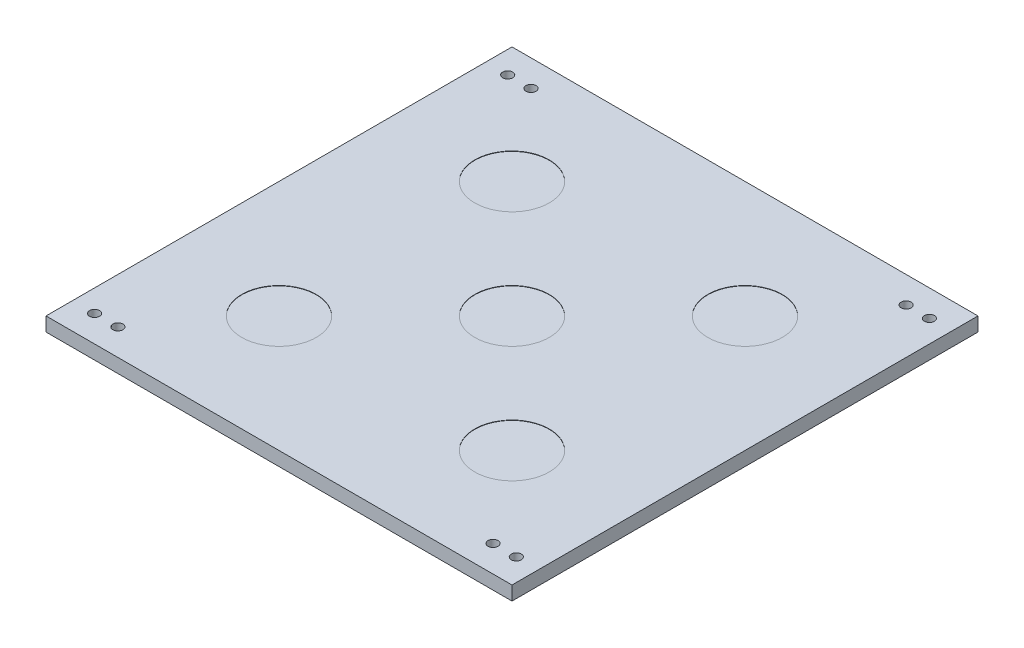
ISO-10303-21;
HEADER;
FILE_DESCRIPTION(('STEP AP214'),'2;1');
FILE_NAME('part.step','',(''),(''),'','','');
FILE_SCHEMA(('AUTOMOTIVE_DESIGN { 1 0 10303 214 1 1 1 1 }'));
ENDSEC;
DATA;
#1=APPLICATION_CONTEXT('core data for automotive mechanical design processes');
#2=APPLICATION_PROTOCOL_DEFINITION('international standard','automotive_design',2000,#1);
#3=PRODUCT_CONTEXT('',#1,'mechanical');
#4=PRODUCT('Part','Part','',(#3));
#5=PRODUCT_RELATED_PRODUCT_CATEGORY('part','',(#4));
#6=PRODUCT_DEFINITION_FORMATION('','',#4);
#7=PRODUCT_DEFINITION_CONTEXT('part definition',#1,'design');
#8=PRODUCT_DEFINITION('design','',#6,#7);
#9=PRODUCT_DEFINITION_SHAPE('','',#8);
#10=(LENGTH_UNIT() NAMED_UNIT(*) SI_UNIT(.MILLI.,.METRE.));
#11=(NAMED_UNIT(*) PLANE_ANGLE_UNIT() SI_UNIT($,.RADIAN.));
#12=(NAMED_UNIT(*) SI_UNIT($,.STERADIAN.) SOLID_ANGLE_UNIT());
#13=UNCERTAINTY_MEASURE_WITH_UNIT(LENGTH_MEASURE(1.E-05),#10,'distance_accuracy_value','');
#14=(GEOMETRIC_REPRESENTATION_CONTEXT(3) GLOBAL_UNCERTAINTY_ASSIGNED_CONTEXT((#13)) GLOBAL_UNIT_ASSIGNED_CONTEXT((#10,
#11,#12)) REPRESENTATION_CONTEXT('',''));
#15=CARTESIAN_POINT('',(0.,0.,0.));
#16=DIRECTION('',(0.,0.,1.));
#17=DIRECTION('',(1.,0.,0.));
#18=AXIS2_PLACEMENT_3D('',#15,#16,#17);
#19=CARTESIAN_POINT('',(0.,6.,0.));
#20=DIRECTION('',(0.,1.,0.));
#21=DIRECTION('',(0.,0.,1.));
#22=AXIS2_PLACEMENT_3D('',#19,#20,#21);
#23=PLANE('',#22);
#24=CARTESIAN_POINT('',(-50.0000000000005,6.,49.9999999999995));
#25=DIRECTION('',(0.,1.,0.));
#26=DIRECTION('',(0.,0.,1.));
#27=AXIS2_PLACEMENT_3D('',#24,#25,#26);
#28=CIRCLE('',#27,16.);
#29=CARTESIAN_POINT('',(-50.0000000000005,6.,65.9999999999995));
#30=VERTEX_POINT('',#29);
#31=EDGE_CURVE('E178',#30,#30,#28,.T.);
#32=ORIENTED_EDGE('',*,*,#31,.F.);
#33=EDGE_LOOP('',(#32));
#34=FACE_BOUND('',#33,.T.);
#35=CARTESIAN_POINT('',(49.9999999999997,6.,50.0000000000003));
#36=DIRECTION('',(0.,1.,0.));
#37=DIRECTION('',(0.,0.,1.));
#38=AXIS2_PLACEMENT_3D('',#35,#36,#37);
#39=CIRCLE('',#38,16.);
#40=CARTESIAN_POINT('',(49.9999999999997,6.,66.0000000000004));
#41=VERTEX_POINT('',#40);
#42=EDGE_CURVE('E184',#41,#41,#39,.T.);
#43=ORIENTED_EDGE('',*,*,#42,.F.);
#44=EDGE_LOOP('',(#43));
#45=FACE_BOUND('',#44,.T.);
#46=CARTESIAN_POINT('',(50.0000000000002,6.,-49.9999999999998));
#47=DIRECTION('',(0.,1.,0.));
#48=DIRECTION('',(0.,0.,1.));
#49=AXIS2_PLACEMENT_3D('',#46,#47,#48);
#50=CIRCLE('',#49,16.);
#51=CARTESIAN_POINT('',(50.0000000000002,6.,-33.9999999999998));
#52=VERTEX_POINT('',#51);
#53=EDGE_CURVE('E190',#52,#52,#50,.T.);
#54=ORIENTED_EDGE('',*,*,#53,.F.);
#55=EDGE_LOOP('',(#54));
#56=FACE_BOUND('',#55,.T.);
#57=CARTESIAN_POINT('',(-50.,6.,-50.));
#58=DIRECTION('',(0.,1.,0.));
#59=DIRECTION('',(0.,0.,1.));
#60=AXIS2_PLACEMENT_3D('',#57,#58,#59);
#61=CIRCLE('',#60,16.);
#62=CARTESIAN_POINT('',(-50.,6.,-34.));
#63=VERTEX_POINT('',#62);
#64=EDGE_CURVE('E172',#63,#63,#61,.T.);
#65=ORIENTED_EDGE('',*,*,#64,.F.);
#66=EDGE_LOOP('',(#65));
#67=FACE_BOUND('',#66,.T.);
#68=CARTESIAN_POINT('',(0.,6.,0.));
#69=DIRECTION('',(0.,1.,0.));
#70=DIRECTION('',(0.,0.,1.));
#71=AXIS2_PLACEMENT_3D('',#68,#69,#70);
#72=CIRCLE('',#71,16.);
#73=CARTESIAN_POINT('',(0.,6.,16.));
#74=VERTEX_POINT('',#73);
#75=EDGE_CURVE('E169',#74,#74,#72,.T.);
#76=ORIENTED_EDGE('',*,*,#75,.F.);
#77=EDGE_LOOP('',(#76));
#78=FACE_BOUND('',#77,.T.);
#79=CARTESIAN_POINT('',(-80.5,6.,88.65));
#80=DIRECTION('',(0.,1.,0.));
#81=DIRECTION('',(0.,0.,-1.));
#82=AXIS2_PLACEMENT_3D('',#79,#80,#81);
#83=CIRCLE('',#82,2.15);
#84=CARTESIAN_POINT('',(-80.5,6.,86.5));
#85=VERTEX_POINT('',#84);
#86=EDGE_CURVE('E154',#85,#85,#83,.T.);
#87=ORIENTED_EDGE('',*,*,#86,.F.);
#88=EDGE_LOOP('',(#87));
#89=FACE_BOUND('',#88,.T.);
#90=CARTESIAN_POINT('',(90.5,6.,88.65));
#91=DIRECTION('',(0.,1.,0.));
#92=DIRECTION('',(0.,0.,1.));
#93=AXIS2_PLACEMENT_3D('',#90,#91,#92);
#94=CIRCLE('',#93,2.15);
#95=CARTESIAN_POINT('',(90.5,6.,90.8));
#96=VERTEX_POINT('',#95);
#97=EDGE_CURVE('E142',#96,#96,#94,.T.);
#98=ORIENTED_EDGE('',*,*,#97,.F.);
#99=EDGE_LOOP('',(#98));
#100=FACE_BOUND('',#99,.T.);
#101=CARTESIAN_POINT('',(80.5,6.,-88.65));
#102=DIRECTION('',(0.,1.,0.));
#103=DIRECTION('',(0.,0.,-1.));
#104=AXIS2_PLACEMENT_3D('',#101,#102,#103);
#105=CIRCLE('',#104,2.15);
#106=CARTESIAN_POINT('',(80.5,6.,-90.8));
#107=VERTEX_POINT('',#106);
#108=EDGE_CURVE('E130',#107,#107,#105,.T.);
#109=ORIENTED_EDGE('',*,*,#108,.F.);
#110=EDGE_LOOP('',(#109));
#111=FACE_BOUND('',#110,.T.);
#112=CARTESIAN_POINT('',(-80.5,6.,-88.65));
#113=DIRECTION('',(0.,1.,0.));
#114=DIRECTION('',(0.,0.,1.));
#115=AXIS2_PLACEMENT_3D('',#112,#113,#114);
#116=CIRCLE('',#115,2.15);
#117=CARTESIAN_POINT('',(-80.5,6.,-86.5));
#118=VERTEX_POINT('',#117);
#119=EDGE_CURVE('E109',#118,#118,#116,.T.);
#120=ORIENTED_EDGE('',*,*,#119,.F.);
#121=EDGE_LOOP('',(#120));
#122=FACE_BOUND('',#121,.T.);
#123=DIRECTION('',(0.,0.,1.));
#124=VECTOR('',#123,1.);
#125=CARTESIAN_POINT('',(-100.,6.,100.));
#126=LINE('',#125,#124);
#127=CARTESIAN_POINT('',(-100.,6.,-100.));
#128=VERTEX_POINT('',#127);
#129=CARTESIAN_POINT('',(-100.,6.,100.));
#130=VERTEX_POINT('',#129);
#131=EDGE_CURVE('E94',#128,#130,#126,.T.);
#132=ORIENTED_EDGE('',*,*,#131,.T.);
#133=DIRECTION('',(1.,0.,0.));
#134=VECTOR('',#133,1.);
#135=CARTESIAN_POINT('',(100.,6.,100.));
#136=LINE('',#135,#134);
#137=CARTESIAN_POINT('',(100.,6.,100.));
#138=VERTEX_POINT('',#137);
#139=EDGE_CURVE('E89',#130,#138,#136,.T.);
#140=ORIENTED_EDGE('',*,*,#139,.T.);
#141=DIRECTION('',(0.,0.,-1.));
#142=VECTOR('',#141,1.);
#143=CARTESIAN_POINT('',(100.,6.,100.));
#144=LINE('',#143,#142);
#145=CARTESIAN_POINT('',(100.,6.,-100.));
#146=VERTEX_POINT('',#145);
#147=EDGE_CURVE('E92',#138,#146,#144,.T.);
#148=ORIENTED_EDGE('',*,*,#147,.T.);
#149=DIRECTION('',(-1.,0.,0.));
#150=VECTOR('',#149,1.);
#151=CARTESIAN_POINT('',(100.,6.,-100.));
#152=LINE('',#151,#150);
#153=EDGE_CURVE('E59',#146,#128,#152,.T.);
#154=ORIENTED_EDGE('',*,*,#153,.T.);
#155=EDGE_LOOP('',(#132,#140,#148,#154));
#156=FACE_BOUND('',#155,.T.);
#157=CARTESIAN_POINT('',(-90.5,6.,-88.65));
#158=DIRECTION('',(0.,1.,0.));
#159=DIRECTION('',(0.,0.,1.));
#160=AXIS2_PLACEMENT_3D('',#157,#158,#159);
#161=CIRCLE('',#160,2.15);
#162=CARTESIAN_POINT('',(-90.5,6.,-86.5));
#163=VERTEX_POINT('',#162);
#164=EDGE_CURVE('E124',#163,#163,#161,.T.);
#165=ORIENTED_EDGE('',*,*,#164,.F.);
#166=EDGE_LOOP('',(#165));
#167=FACE_BOUND('',#166,.T.);
#168=CARTESIAN_POINT('',(90.5,6.,-88.65));
#169=DIRECTION('',(0.,1.,0.));
#170=DIRECTION('',(0.,0.,-1.));
#171=AXIS2_PLACEMENT_3D('',#168,#169,#170);
#172=CIRCLE('',#171,2.15);
#173=CARTESIAN_POINT('',(90.5,6.,-90.8));
#174=VERTEX_POINT('',#173);
#175=EDGE_CURVE('E136',#174,#174,#172,.T.);
#176=ORIENTED_EDGE('',*,*,#175,.F.);
#177=EDGE_LOOP('',(#176));
#178=FACE_BOUND('',#177,.T.);
#179=CARTESIAN_POINT('',(80.5,6.,88.65));
#180=DIRECTION('',(0.,1.,0.));
#181=DIRECTION('',(0.,0.,1.));
#182=AXIS2_PLACEMENT_3D('',#179,#180,#181);
#183=CIRCLE('',#182,2.15);
#184=CARTESIAN_POINT('',(80.5,6.,90.8));
#185=VERTEX_POINT('',#184);
#186=EDGE_CURVE('E148',#185,#185,#183,.T.);
#187=ORIENTED_EDGE('',*,*,#186,.F.);
#188=EDGE_LOOP('',(#187));
#189=FACE_BOUND('',#188,.T.);
#190=CARTESIAN_POINT('',(-90.5,6.,88.65));
#191=DIRECTION('',(0.,1.,0.));
#192=DIRECTION('',(0.,0.,-1.));
#193=AXIS2_PLACEMENT_3D('',#190,#191,#192);
#194=CIRCLE('',#193,2.15);
#195=CARTESIAN_POINT('',(-90.5,6.,86.5));
#196=VERTEX_POINT('',#195);
#197=EDGE_CURVE('E160',#196,#196,#194,.T.);
#198=ORIENTED_EDGE('',*,*,#197,.F.);
#199=EDGE_LOOP('',(#198));
#200=FACE_BOUND('',#199,.T.);
#201=ADVANCED_FACE('F42',(#34,#45,#56,#67,#78,#89,#100,#111,#122,#156,#167,#178,#189,#200),#23,.T.);
#202=CARTESIAN_POINT('',(0.,0.,0.));
#203=DIRECTION('',(0.,1.,0.));
#204=DIRECTION('',(0.,0.,1.));
#205=AXIS2_PLACEMENT_3D('',#202,#203,#204);
#206=PLANE('',#205);
#207=DIRECTION('',(0.,0.,1.));
#208=VECTOR('',#207,1.);
#209=CARTESIAN_POINT('',(-100.,0.,100.));
#210=LINE('',#209,#208);
#211=CARTESIAN_POINT('',(-100.,0.,-100.));
#212=VERTEX_POINT('',#211);
#213=CARTESIAN_POINT('',(-100.,0.,100.));
#214=VERTEX_POINT('',#213);
#215=EDGE_CURVE('E106',#212,#214,#210,.T.);
#216=ORIENTED_EDGE('',*,*,#215,.F.);
#217=DIRECTION('',(-1.,0.,0.));
#218=VECTOR('',#217,1.);
#219=CARTESIAN_POINT('',(100.,0.,-100.));
#220=LINE('',#219,#218);
#221=CARTESIAN_POINT('',(100.,0.,-100.));
#222=VERTEX_POINT('',#221);
#223=EDGE_CURVE('E82',#222,#212,#220,.T.);
#224=ORIENTED_EDGE('',*,*,#223,.F.);
#225=DIRECTION('',(0.,0.,-1.));
#226=VECTOR('',#225,1.);
#227=CARTESIAN_POINT('',(100.,0.,100.));
#228=LINE('',#227,#226);
#229=CARTESIAN_POINT('',(100.,0.,100.));
#230=VERTEX_POINT('',#229);
#231=EDGE_CURVE('E76',#230,#222,#228,.T.);
#232=ORIENTED_EDGE('',*,*,#231,.F.);
#233=DIRECTION('',(1.,0.,0.));
#234=VECTOR('',#233,1.);
#235=CARTESIAN_POINT('',(100.,0.,100.));
#236=LINE('',#235,#234);
#237=EDGE_CURVE('E98',#214,#230,#236,.T.);
#238=ORIENTED_EDGE('',*,*,#237,.F.);
#239=EDGE_LOOP('',(#216,#224,#232,#238));
#240=FACE_BOUND('',#239,.T.);
#241=CARTESIAN_POINT('',(-80.5,0.,-88.65));
#242=DIRECTION('',(0.,1.,0.));
#243=DIRECTION('',(0.,0.,1.));
#244=AXIS2_PLACEMENT_3D('',#241,#242,#243);
#245=CIRCLE('',#244,2.15);
#246=CARTESIAN_POINT('',(-80.5,0.,-86.5));
#247=VERTEX_POINT('',#246);
#248=EDGE_CURVE('E121',#247,#247,#245,.T.);
#249=ORIENTED_EDGE('',*,*,#248,.T.);
#250=EDGE_LOOP('',(#249));
#251=FACE_BOUND('',#250,.T.);
#252=CARTESIAN_POINT('',(-90.5,0.,-88.65));
#253=DIRECTION('',(0.,1.,0.));
#254=DIRECTION('',(0.,0.,1.));
#255=AXIS2_PLACEMENT_3D('',#252,#253,#254);
#256=CIRCLE('',#255,2.15);
#257=CARTESIAN_POINT('',(-90.5,0.,-86.5));
#258=VERTEX_POINT('',#257);
#259=EDGE_CURVE('E127',#258,#258,#256,.T.);
#260=ORIENTED_EDGE('',*,*,#259,.T.);
#261=EDGE_LOOP('',(#260));
#262=FACE_BOUND('',#261,.T.);
#263=CARTESIAN_POINT('',(80.5,0.,-88.65));
#264=DIRECTION('',(0.,1.,0.));
#265=DIRECTION('',(0.,0.,-1.));
#266=AXIS2_PLACEMENT_3D('',#263,#264,#265);
#267=CIRCLE('',#266,2.15);
#268=CARTESIAN_POINT('',(80.5,0.,-90.8));
#269=VERTEX_POINT('',#268);
#270=EDGE_CURVE('E133',#269,#269,#267,.T.);
#271=ORIENTED_EDGE('',*,*,#270,.T.);
#272=EDGE_LOOP('',(#271));
#273=FACE_BOUND('',#272,.T.);
#274=CARTESIAN_POINT('',(90.5,0.,-88.65));
#275=DIRECTION('',(0.,1.,0.));
#276=DIRECTION('',(0.,0.,-1.));
#277=AXIS2_PLACEMENT_3D('',#274,#275,#276);
#278=CIRCLE('',#277,2.15);
#279=CARTESIAN_POINT('',(90.5,0.,-90.8));
#280=VERTEX_POINT('',#279);
#281=EDGE_CURVE('E139',#280,#280,#278,.T.);
#282=ORIENTED_EDGE('',*,*,#281,.T.);
#283=EDGE_LOOP('',(#282));
#284=FACE_BOUND('',#283,.T.);
#285=CARTESIAN_POINT('',(90.5,0.,88.65));
#286=DIRECTION('',(0.,1.,0.));
#287=DIRECTION('',(0.,0.,1.));
#288=AXIS2_PLACEMENT_3D('',#285,#286,#287);
#289=CIRCLE('',#288,2.15);
#290=CARTESIAN_POINT('',(90.5,0.,90.8));
#291=VERTEX_POINT('',#290);
#292=EDGE_CURVE('E145',#291,#291,#289,.T.);
#293=ORIENTED_EDGE('',*,*,#292,.T.);
#294=EDGE_LOOP('',(#293));
#295=FACE_BOUND('',#294,.T.);
#296=CARTESIAN_POINT('',(80.5,0.,88.65));
#297=DIRECTION('',(0.,1.,0.));
#298=DIRECTION('',(0.,0.,1.));
#299=AXIS2_PLACEMENT_3D('',#296,#297,#298);
#300=CIRCLE('',#299,2.15);
#301=CARTESIAN_POINT('',(80.5,0.,90.8));
#302=VERTEX_POINT('',#301);
#303=EDGE_CURVE('E151',#302,#302,#300,.T.);
#304=ORIENTED_EDGE('',*,*,#303,.T.);
#305=EDGE_LOOP('',(#304));
#306=FACE_BOUND('',#305,.T.);
#307=CARTESIAN_POINT('',(-80.5,0.,88.65));
#308=DIRECTION('',(0.,1.,0.));
#309=DIRECTION('',(0.,0.,-1.));
#310=AXIS2_PLACEMENT_3D('',#307,#308,#309);
#311=CIRCLE('',#310,2.15);
#312=CARTESIAN_POINT('',(-80.5,0.,86.5));
#313=VERTEX_POINT('',#312);
#314=EDGE_CURVE('E157',#313,#313,#311,.T.);
#315=ORIENTED_EDGE('',*,*,#314,.T.);
#316=EDGE_LOOP('',(#315));
#317=FACE_BOUND('',#316,.T.);
#318=CARTESIAN_POINT('',(-90.5,0.,88.65));
#319=DIRECTION('',(0.,1.,0.));
#320=DIRECTION('',(0.,0.,-1.));
#321=AXIS2_PLACEMENT_3D('',#318,#319,#320);
#322=CIRCLE('',#321,2.15);
#323=CARTESIAN_POINT('',(-90.5,0.,86.5));
#324=VERTEX_POINT('',#323);
#325=EDGE_CURVE('E163',#324,#324,#322,.T.);
#326=ORIENTED_EDGE('',*,*,#325,.T.);
#327=EDGE_LOOP('',(#326));
#328=FACE_BOUND('',#327,.T.);
#329=ADVANCED_FACE('F117',(#240,#251,#262,#273,#284,#295,#306,#317,#328),#206,.F.);
#330=CARTESIAN_POINT('',(-100.,6.,100.));
#331=DIRECTION('',(1.,0.,0.));
#332=DIRECTION('',(0.,0.,-1.));
#333=AXIS2_PLACEMENT_3D('',#330,#331,#332);
#334=PLANE('',#333);
#335=ORIENTED_EDGE('',*,*,#215,.T.);
#336=DIRECTION('',(0.,-1.,0.));
#337=VECTOR('',#336,1.);
#338=CARTESIAN_POINT('',(-100.,6.,100.));
#339=LINE('',#338,#337);
#340=EDGE_CURVE('E11',#130,#214,#339,.T.);
#341=ORIENTED_EDGE('',*,*,#340,.F.);
#342=ORIENTED_EDGE('',*,*,#131,.F.);
#343=DIRECTION('',(0.,-1.,0.));
#344=VECTOR('',#343,1.);
#345=CARTESIAN_POINT('',(-100.,6.,-100.));
#346=LINE('',#345,#344);
#347=EDGE_CURVE('E102',#128,#212,#346,.T.);
#348=ORIENTED_EDGE('',*,*,#347,.T.);
#349=EDGE_LOOP('',(#335,#341,#342,#348));
#350=FACE_BOUND('',#349,.T.);
#351=ADVANCED_FACE('F44',(#350),#334,.F.);
#352=CARTESIAN_POINT('',(100.,6.,100.));
#353=DIRECTION('',(0.,0.,-1.));
#354=DIRECTION('',(-1.,0.,0.));
#355=AXIS2_PLACEMENT_3D('',#352,#353,#354);
#356=PLANE('',#355);
#357=ORIENTED_EDGE('',*,*,#237,.T.);
#358=DIRECTION('',(0.,-1.,0.));
#359=VECTOR('',#358,1.);
#360=CARTESIAN_POINT('',(100.,6.,100.));
#361=LINE('',#360,#359);
#362=EDGE_CURVE('E51',#138,#230,#361,.T.);
#363=ORIENTED_EDGE('',*,*,#362,.F.);
#364=ORIENTED_EDGE('',*,*,#139,.F.);
#365=ORIENTED_EDGE('',*,*,#340,.T.);
#366=EDGE_LOOP('',(#357,#363,#364,#365));
#367=FACE_BOUND('',#366,.T.);
#368=ADVANCED_FACE('F97',(#367),#356,.F.);
#369=CARTESIAN_POINT('',(100.,6.,100.));
#370=DIRECTION('',(-1.,0.,0.));
#371=DIRECTION('',(0.,0.,1.));
#372=AXIS2_PLACEMENT_3D('',#369,#370,#371);
#373=PLANE('',#372);
#374=ORIENTED_EDGE('',*,*,#231,.T.);
#375=DIRECTION('',(0.,-1.,0.));
#376=VECTOR('',#375,1.);
#377=CARTESIAN_POINT('',(100.,6.,-100.));
#378=LINE('',#377,#376);
#379=EDGE_CURVE('E99',#146,#222,#378,.T.);
#380=ORIENTED_EDGE('',*,*,#379,.F.);
#381=ORIENTED_EDGE('',*,*,#147,.F.);
#382=ORIENTED_EDGE('',*,*,#362,.T.);
#383=EDGE_LOOP('',(#374,#380,#381,#382));
#384=FACE_BOUND('',#383,.T.);
#385=ADVANCED_FACE('F100',(#384),#373,.F.);
#386=CARTESIAN_POINT('',(100.,6.,-100.));
#387=DIRECTION('',(0.,0.,1.));
#388=DIRECTION('',(1.,0.,0.));
#389=AXIS2_PLACEMENT_3D('',#386,#387,#388);
#390=PLANE('',#389);
#391=ORIENTED_EDGE('',*,*,#223,.T.);
#392=ORIENTED_EDGE('',*,*,#347,.F.);
#393=ORIENTED_EDGE('',*,*,#153,.F.);
#394=ORIENTED_EDGE('',*,*,#379,.T.);
#395=EDGE_LOOP('',(#391,#392,#393,#394));
#396=FACE_BOUND('',#395,.T.);
#397=ADVANCED_FACE('F114',(#396),#390,.F.);
#398=CARTESIAN_POINT('',(-80.5,6.,-88.65));
#399=DIRECTION('',(0.,-1.,0.));
#400=DIRECTION('',(0.,0.,-1.));
#401=AXIS2_PLACEMENT_3D('',#398,#399,#400);
#402=CYLINDRICAL_SURFACE('',#401,2.15);
#403=ORIENTED_EDGE('',*,*,#119,.T.);
#404=EDGE_LOOP('',(#403));
#405=FACE_BOUND('',#404,.T.);
#406=ORIENTED_EDGE('',*,*,#248,.F.);
#407=EDGE_LOOP('',(#406));
#408=FACE_BOUND('',#407,.T.);
#409=ADVANCED_FACE('F215',(#405,#408),#402,.F.);
#410=CARTESIAN_POINT('',(-90.5,6.,-88.65));
#411=DIRECTION('',(0.,-1.,0.));
#412=DIRECTION('',(0.,0.,-1.));
#413=AXIS2_PLACEMENT_3D('',#410,#411,#412);
#414=CYLINDRICAL_SURFACE('',#413,2.15);
#415=ORIENTED_EDGE('',*,*,#164,.T.);
#416=EDGE_LOOP('',(#415));
#417=FACE_BOUND('',#416,.T.);
#418=ORIENTED_EDGE('',*,*,#259,.F.);
#419=EDGE_LOOP('',(#418));
#420=FACE_BOUND('',#419,.T.);
#421=ADVANCED_FACE('F218',(#417,#420),#414,.F.);
#422=CARTESIAN_POINT('',(80.5,6.,-88.65));
#423=DIRECTION('',(0.,-1.,0.));
#424=DIRECTION('',(0.,0.,-1.));
#425=AXIS2_PLACEMENT_3D('',#422,#423,#424);
#426=CYLINDRICAL_SURFACE('',#425,2.15);
#427=ORIENTED_EDGE('',*,*,#108,.T.);
#428=EDGE_LOOP('',(#427));
#429=FACE_BOUND('',#428,.T.);
#430=ORIENTED_EDGE('',*,*,#270,.F.);
#431=EDGE_LOOP('',(#430));
#432=FACE_BOUND('',#431,.T.);
#433=ADVANCED_FACE('F266',(#429,#432),#426,.F.);
#434=CARTESIAN_POINT('',(90.5,6.,-88.65));
#435=DIRECTION('',(0.,-1.,0.));
#436=DIRECTION('',(0.,0.,-1.));
#437=AXIS2_PLACEMENT_3D('',#434,#435,#436);
#438=CYLINDRICAL_SURFACE('',#437,2.15);
#439=ORIENTED_EDGE('',*,*,#175,.T.);
#440=EDGE_LOOP('',(#439));
#441=FACE_BOUND('',#440,.T.);
#442=ORIENTED_EDGE('',*,*,#281,.F.);
#443=EDGE_LOOP('',(#442));
#444=FACE_BOUND('',#443,.T.);
#445=ADVANCED_FACE('F262',(#441,#444),#438,.F.);
#446=CARTESIAN_POINT('',(90.5,6.,88.65));
#447=DIRECTION('',(0.,-1.,0.));
#448=DIRECTION('',(0.,0.,-1.));
#449=AXIS2_PLACEMENT_3D('',#446,#447,#448);
#450=CYLINDRICAL_SURFACE('',#449,2.15);
#451=ORIENTED_EDGE('',*,*,#97,.T.);
#452=EDGE_LOOP('',(#451));
#453=FACE_BOUND('',#452,.T.);
#454=ORIENTED_EDGE('',*,*,#292,.F.);
#455=EDGE_LOOP('',(#454));
#456=FACE_BOUND('',#455,.T.);
#457=ADVANCED_FACE('F258',(#453,#456),#450,.F.);
#458=CARTESIAN_POINT('',(80.5,6.,88.65));
#459=DIRECTION('',(0.,-1.,0.));
#460=DIRECTION('',(0.,0.,-1.));
#461=AXIS2_PLACEMENT_3D('',#458,#459,#460);
#462=CYLINDRICAL_SURFACE('',#461,2.15);
#463=ORIENTED_EDGE('',*,*,#186,.T.);
#464=EDGE_LOOP('',(#463));
#465=FACE_BOUND('',#464,.T.);
#466=ORIENTED_EDGE('',*,*,#303,.F.);
#467=EDGE_LOOP('',(#466));
#468=FACE_BOUND('',#467,.T.);
#469=ADVANCED_FACE('F251',(#465,#468),#462,.F.);
#470=CARTESIAN_POINT('',(-80.5,6.,88.65));
#471=DIRECTION('',(0.,-1.,0.));
#472=DIRECTION('',(0.,0.,-1.));
#473=AXIS2_PLACEMENT_3D('',#470,#471,#472);
#474=CYLINDRICAL_SURFACE('',#473,2.15);
#475=ORIENTED_EDGE('',*,*,#86,.T.);
#476=EDGE_LOOP('',(#475));
#477=FACE_BOUND('',#476,.T.);
#478=ORIENTED_EDGE('',*,*,#314,.F.);
#479=EDGE_LOOP('',(#478));
#480=FACE_BOUND('',#479,.T.);
#481=ADVANCED_FACE('F241',(#477,#480),#474,.F.);
#482=CARTESIAN_POINT('',(-90.5,6.,88.65));
#483=DIRECTION('',(0.,-1.,0.));
#484=DIRECTION('',(0.,0.,-1.));
#485=AXIS2_PLACEMENT_3D('',#482,#483,#484);
#486=CYLINDRICAL_SURFACE('',#485,2.15);
#487=ORIENTED_EDGE('',*,*,#197,.T.);
#488=EDGE_LOOP('',(#487));
#489=FACE_BOUND('',#488,.T.);
#490=ORIENTED_EDGE('',*,*,#325,.F.);
#491=EDGE_LOOP('',(#490));
#492=FACE_BOUND('',#491,.T.);
#493=ADVANCED_FACE('F238',(#489,#492),#486,.F.);
#494=CARTESIAN_POINT('',(0.,5.85,0.));
#495=DIRECTION('',(0.,1.,0.));
#496=DIRECTION('',(0.,0.,1.));
#497=AXIS2_PLACEMENT_3D('',#494,#495,#496);
#498=CYLINDRICAL_SURFACE('',#497,16.);
#499=CARTESIAN_POINT('',(0.,5.85,0.));
#500=DIRECTION('',(0.,1.,0.));
#501=DIRECTION('',(0.,0.,1.));
#502=AXIS2_PLACEMENT_3D('',#499,#500,#501);
#503=CIRCLE('',#502,16.);
#504=CARTESIAN_POINT('',(0.,5.85,16.));
#505=VERTEX_POINT('',#504);
#506=EDGE_CURVE('E166',#505,#505,#503,.T.);
#507=ORIENTED_EDGE('',*,*,#506,.F.);
#508=EDGE_LOOP('',(#507));
#509=FACE_BOUND('',#508,.T.);
#510=ORIENTED_EDGE('',*,*,#75,.T.);
#511=EDGE_LOOP('',(#510));
#512=FACE_BOUND('',#511,.T.);
#513=ADVANCED_FACE('F240',(#509,#512),#498,.F.);
#514=CARTESIAN_POINT('',(0.,5.85,0.));
#515=DIRECTION('',(0.,1.,0.));
#516=DIRECTION('',(0.,0.,1.));
#517=AXIS2_PLACEMENT_3D('',#514,#515,#516);
#518=PLANE('',#517);
#519=ORIENTED_EDGE('',*,*,#506,.T.);
#520=EDGE_LOOP('',(#519));
#521=FACE_BOUND('',#520,.T.);
#522=ADVANCED_FACE('F248',(#521),#518,.T.);
#523=CARTESIAN_POINT('',(-50.,5.85,-50.));
#524=DIRECTION('',(0.,1.,0.));
#525=DIRECTION('',(0.,0.,1.));
#526=AXIS2_PLACEMENT_3D('',#523,#524,#525);
#527=CYLINDRICAL_SURFACE('',#526,16.);
#528=CARTESIAN_POINT('',(-50.,5.85,-50.));
#529=DIRECTION('',(0.,1.,0.));
#530=DIRECTION('',(0.,0.,1.));
#531=AXIS2_PLACEMENT_3D('',#528,#529,#530);
#532=CIRCLE('',#531,16.);
#533=CARTESIAN_POINT('',(-50.,5.85,-34.));
#534=VERTEX_POINT('',#533);
#535=EDGE_CURVE('E193',#534,#534,#532,.T.);
#536=ORIENTED_EDGE('',*,*,#535,.F.);
#537=EDGE_LOOP('',(#536));
#538=FACE_BOUND('',#537,.T.);
#539=ORIENTED_EDGE('',*,*,#64,.T.);
#540=EDGE_LOOP('',(#539));
#541=FACE_BOUND('',#540,.T.);
#542=ADVANCED_FACE('F199',(#538,#541),#527,.F.);
#543=CARTESIAN_POINT('',(-50.,5.85,-50.));
#544=DIRECTION('',(0.,1.,0.));
#545=DIRECTION('',(0.,0.,1.));
#546=AXIS2_PLACEMENT_3D('',#543,#544,#545);
#547=PLANE('',#546);
#548=ORIENTED_EDGE('',*,*,#535,.T.);
#549=EDGE_LOOP('',(#548));
#550=FACE_BOUND('',#549,.T.);
#551=ADVANCED_FACE('F314',(#550),#547,.T.);
#552=CARTESIAN_POINT('',(50.0000000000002,5.85,-49.9999999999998));
#553=DIRECTION('',(0.,1.,0.));
#554=DIRECTION('',(0.,0.,1.));
#555=AXIS2_PLACEMENT_3D('',#552,#553,#554);
#556=CYLINDRICAL_SURFACE('',#555,16.);
#557=CARTESIAN_POINT('',(50.0000000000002,5.85,-49.9999999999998));
#558=DIRECTION('',(0.,1.,0.));
#559=DIRECTION('',(0.,0.,1.));
#560=AXIS2_PLACEMENT_3D('',#557,#558,#559);
#561=CIRCLE('',#560,16.);
#562=CARTESIAN_POINT('',(50.0000000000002,5.85,-33.9999999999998));
#563=VERTEX_POINT('',#562);
#564=EDGE_CURVE('E187',#563,#563,#561,.T.);
#565=ORIENTED_EDGE('',*,*,#564,.F.);
#566=EDGE_LOOP('',(#565));
#567=FACE_BOUND('',#566,.T.);
#568=ORIENTED_EDGE('',*,*,#53,.T.);
#569=EDGE_LOOP('',(#568));
#570=FACE_BOUND('',#569,.T.);
#571=ADVANCED_FACE('F323',(#567,#570),#556,.F.);
#572=CARTESIAN_POINT('',(50.0000000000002,5.85,-49.9999999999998));
#573=DIRECTION('',(0.,1.,0.));
#574=DIRECTION('',(0.,0.,1.));
#575=AXIS2_PLACEMENT_3D('',#572,#573,#574);
#576=PLANE('',#575);
#577=ORIENTED_EDGE('',*,*,#564,.T.);
#578=EDGE_LOOP('',(#577));
#579=FACE_BOUND('',#578,.T.);
#580=ADVANCED_FACE('F332',(#579),#576,.T.);
#581=CARTESIAN_POINT('',(49.9999999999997,5.85,50.0000000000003));
#582=DIRECTION('',(0.,1.,0.));
#583=DIRECTION('',(0.,0.,1.));
#584=AXIS2_PLACEMENT_3D('',#581,#582,#583);
#585=CYLINDRICAL_SURFACE('',#584,16.);
#586=CARTESIAN_POINT('',(49.9999999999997,5.85,50.0000000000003));
#587=DIRECTION('',(0.,1.,0.));
#588=DIRECTION('',(0.,0.,1.));
#589=AXIS2_PLACEMENT_3D('',#586,#587,#588);
#590=CIRCLE('',#589,16.);
#591=CARTESIAN_POINT('',(49.9999999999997,5.85,66.0000000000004));
#592=VERTEX_POINT('',#591);
#593=EDGE_CURVE('E181',#592,#592,#590,.T.);
#594=ORIENTED_EDGE('',*,*,#593,.F.);
#595=EDGE_LOOP('',(#594));
#596=FACE_BOUND('',#595,.T.);
#597=ORIENTED_EDGE('',*,*,#42,.T.);
#598=EDGE_LOOP('',(#597));
#599=FACE_BOUND('',#598,.T.);
#600=ADVANCED_FACE('F341',(#596,#599),#585,.F.);
#601=CARTESIAN_POINT('',(49.9999999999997,5.85,50.0000000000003));
#602=DIRECTION('',(0.,1.,0.));
#603=DIRECTION('',(0.,0.,1.));
#604=AXIS2_PLACEMENT_3D('',#601,#602,#603);
#605=PLANE('',#604);
#606=ORIENTED_EDGE('',*,*,#593,.T.);
#607=EDGE_LOOP('',(#606));
#608=FACE_BOUND('',#607,.T.);
#609=ADVANCED_FACE('F350',(#608),#605,.T.);
#610=CARTESIAN_POINT('',(-50.0000000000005,5.85,49.9999999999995));
#611=DIRECTION('',(0.,1.,0.));
#612=DIRECTION('',(0.,0.,1.));
#613=AXIS2_PLACEMENT_3D('',#610,#611,#612);
#614=CYLINDRICAL_SURFACE('',#613,16.);
#615=CARTESIAN_POINT('',(-50.0000000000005,5.85,49.9999999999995));
#616=DIRECTION('',(0.,1.,0.));
#617=DIRECTION('',(0.,0.,1.));
#618=AXIS2_PLACEMENT_3D('',#615,#616,#617);
#619=CIRCLE('',#618,16.);
#620=CARTESIAN_POINT('',(-50.0000000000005,5.85,65.9999999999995));
#621=VERTEX_POINT('',#620);
#622=EDGE_CURVE('E175',#621,#621,#619,.T.);
#623=ORIENTED_EDGE('',*,*,#622,.F.);
#624=EDGE_LOOP('',(#623));
#625=FACE_BOUND('',#624,.T.);
#626=ORIENTED_EDGE('',*,*,#31,.T.);
#627=EDGE_LOOP('',(#626));
#628=FACE_BOUND('',#627,.T.);
#629=ADVANCED_FACE('F359',(#625,#628),#614,.F.);
#630=CARTESIAN_POINT('',(-50.0000000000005,5.85,49.9999999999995));
#631=DIRECTION('',(0.,1.,0.));
#632=DIRECTION('',(0.,0.,1.));
#633=AXIS2_PLACEMENT_3D('',#630,#631,#632);
#634=PLANE('',#633);
#635=ORIENTED_EDGE('',*,*,#622,.T.);
#636=EDGE_LOOP('',(#635));
#637=FACE_BOUND('',#636,.T.);
#638=ADVANCED_FACE('F368',(#637),#634,.T.);
#639=CLOSED_SHELL('',(#201,#329,#351,#368,#385,#397,#409,#421,#433,#445,#457,#469,#481,#493,
#513,#522,#542,#551,#571,#580,#600,#609,#629,#638));
#640=MANIFOLD_SOLID_BREP('B2',#639);
#641=ADVANCED_BREP_SHAPE_REPRESENTATION('',(#18,#640),#14);
#642=SHAPE_DEFINITION_REPRESENTATION(#9,#641);
ENDSEC;
END-ISO-10303-21;
